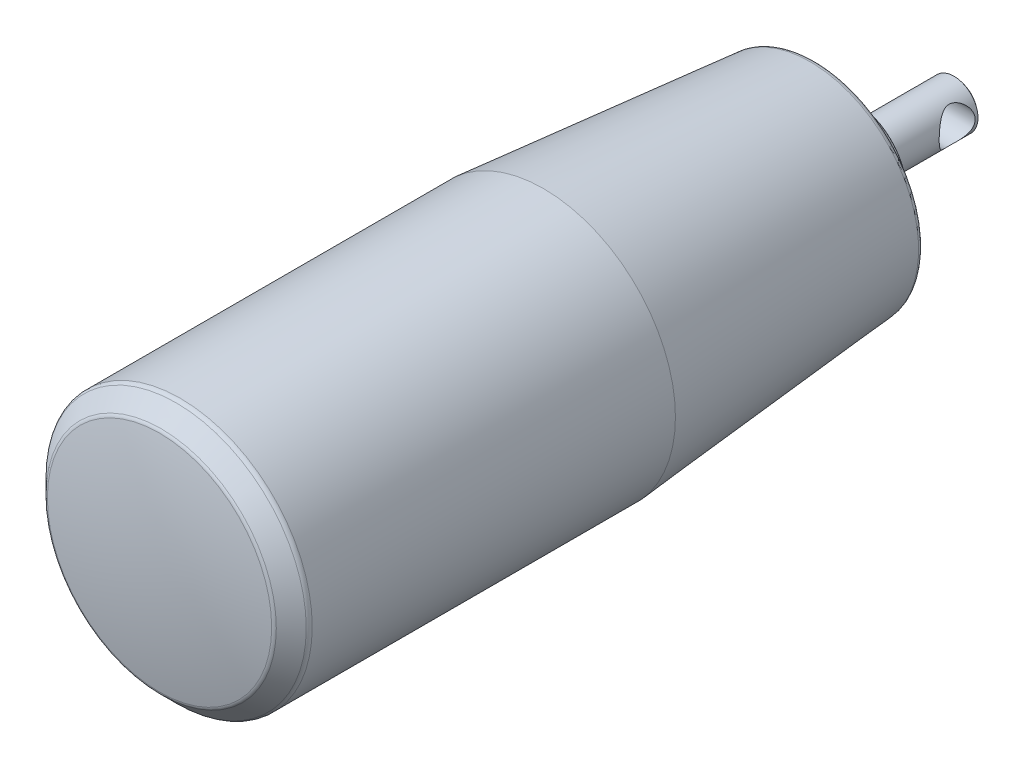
ISO-10303-21;
HEADER;
FILE_DESCRIPTION(('STEP AP214'),'2;1');
FILE_NAME('part.step','',(''),(''),'','','');
FILE_SCHEMA(('AUTOMOTIVE_DESIGN { 1 0 10303 214 1 1 1 1 }'));
ENDSEC;
DATA;
#1=APPLICATION_CONTEXT('core data for automotive mechanical design processes');
#2=APPLICATION_PROTOCOL_DEFINITION('international standard','automotive_design',2000,#1);
#3=PRODUCT_CONTEXT('',#1,'mechanical');
#4=PRODUCT('Part','Part','',(#3));
#5=PRODUCT_RELATED_PRODUCT_CATEGORY('part','',(#4));
#6=PRODUCT_DEFINITION_FORMATION('','',#4);
#7=PRODUCT_DEFINITION_CONTEXT('part definition',#1,'design');
#8=PRODUCT_DEFINITION('design','',#6,#7);
#9=PRODUCT_DEFINITION_SHAPE('','',#8);
#10=(LENGTH_UNIT() NAMED_UNIT(*) SI_UNIT(.MILLI.,.METRE.));
#11=(NAMED_UNIT(*) PLANE_ANGLE_UNIT() SI_UNIT($,.RADIAN.));
#12=(NAMED_UNIT(*) SI_UNIT($,.STERADIAN.) SOLID_ANGLE_UNIT());
#13=UNCERTAINTY_MEASURE_WITH_UNIT(LENGTH_MEASURE(1.E-05),#10,'distance_accuracy_value','');
#14=(GEOMETRIC_REPRESENTATION_CONTEXT(3) GLOBAL_UNCERTAINTY_ASSIGNED_CONTEXT((#13)) GLOBAL_UNIT_ASSIGNED_CONTEXT((#10,
#11,#12)) REPRESENTATION_CONTEXT('',''));
#15=CARTESIAN_POINT('',(0.,0.,0.));
#16=DIRECTION('',(0.,0.,1.));
#17=DIRECTION('',(1.,0.,0.));
#18=AXIS2_PLACEMENT_3D('',#15,#16,#17);
#19=CARTESIAN_POINT('',(0.,2.93123297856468E-06,19.875));
#20=DIRECTION('',(1.,0.,0.));
#21=DIRECTION('',(0.,0.,-1.));
#22=AXIS2_PLACEMENT_3D('',#19,#20,#21);
#23=SPHERICAL_SURFACE('',#22,45.6249999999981);
#24=CARTESIAN_POINT('',(0.,2.93123297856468E-06,19.875));
#25=DIRECTION('',(0.,0.,-1.));
#26=DIRECTION('',(-1.,0.,0.));
#27=AXIS2_PLACEMENT_3D('',#24,#25,#26);
#28=SPHERICAL_SURFACE('',#27,45.6249999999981);
#29=CARTESIAN_POINT('',(0.,0.,64.5308451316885));
#30=DIRECTION('',(0.,0.,-1.));
#31=DIRECTION('',(-1.,0.,0.));
#32=AXIS2_PLACEMENT_3D('',#29,#30,#31);
#33=CIRCLE('',#32,9.3539390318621);
#34=CARTESIAN_POINT('',(-9.3539390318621,0.,64.5308451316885));
#35=VERTEX_POINT('',#34);
#36=EDGE_CURVE('E75',#35,#35,#33,.T.);
#37=ORIENTED_EDGE('',*,*,#36,.F.);
#38=EDGE_LOOP('',(#37));
#39=FACE_BOUND('',#38,.T.);
#40=ADVANCED_FACE('F14',(#39),#28,.T.);
#41=CARTESIAN_POINT('',(0.,2.00000302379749,6.5));
#42=DIRECTION('',(0.,0.,-1.));
#43=DIRECTION('',(-1.,0.,0.));
#44=AXIS2_PLACEMENT_3D('',#41,#42,#43);
#45=PLANE('',#44);
#46=CARTESIAN_POINT('',(0.,0.,6.5));
#47=DIRECTION('',(0.,0.,-1.));
#48=DIRECTION('',(-1.,0.,0.));
#49=AXIS2_PLACEMENT_3D('',#46,#47,#48);
#50=CIRCLE('',#49,2.);
#51=CARTESIAN_POINT('',(-2.,0.,6.5));
#52=VERTEX_POINT('',#51);
#53=EDGE_CURVE('E40',#52,#52,#50,.T.);
#54=ORIENTED_EDGE('',*,*,#53,.F.);
#55=EDGE_LOOP('',(#54));
#56=FACE_BOUND('',#55,.T.);
#57=CARTESIAN_POINT('',(0.,0.,6.5));
#58=DIRECTION('',(0.,0.,-1.));
#59=DIRECTION('',(-1.,0.,0.));
#60=AXIS2_PLACEMENT_3D('',#57,#58,#59);
#61=CIRCLE('',#60,4.07643946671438);
#62=CARTESIAN_POINT('',(-4.07643946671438,0.,6.5));
#63=VERTEX_POINT('',#62);
#64=EDGE_CURVE('E9',#63,#63,#61,.T.);
#65=ORIENTED_EDGE('',*,*,#64,.T.);
#66=EDGE_LOOP('',(#65));
#67=FACE_BOUND('',#66,.T.);
#68=ADVANCED_FACE('F65',(#56,#67),#45,.T.);
#69=CARTESIAN_POINT('',(0.,0.,7.));
#70=DIRECTION('',(0.,0.,-1.));
#71=DIRECTION('',(-1.,0.,0.));
#72=AXIS2_PLACEMENT_3D('',#69,#70,#71);
#73=TOROIDAL_SURFACE('',#72,4.07643946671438,0.500000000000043);
#74=CARTESIAN_POINT('',(0.,0.,6.91780052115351));
#75=DIRECTION('',(0.,0.,-1.));
#76=DIRECTION('',(-1.,0.,0.));
#77=AXIS2_PLACEMENT_3D('',#74,#75,#76);
#78=CIRCLE('',#77,4.5696364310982);
#79=CARTESIAN_POINT('',(-4.5696364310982,0.,6.91780052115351));
#80=VERTEX_POINT('',#79);
#81=EDGE_CURVE('E21',#80,#80,#78,.T.);
#82=ORIENTED_EDGE('',*,*,#81,.T.);
#83=EDGE_LOOP('',(#82));
#84=FACE_BOUND('',#83,.T.);
#85=ORIENTED_EDGE('',*,*,#64,.F.);
#86=EDGE_LOOP('',(#85));
#87=FACE_BOUND('',#86,.T.);
#88=ADVANCED_FACE('F71',(#84,#87),#73,.T.);
#89=CARTESIAN_POINT('',(0.,0.,9.5));
#90=DIRECTION('',(0.,0.,1.));
#91=DIRECTION('',(1.,0.,0.));
#92=AXIS2_PLACEMENT_3D('',#89,#90,#91);
#93=CONICAL_SURFACE('',#92,5.00000293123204,0.165148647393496);
#94=ORIENTED_EDGE('',*,*,#81,.F.);
#95=EDGE_LOOP('',(#94));
#96=FACE_BOUND('',#95,.T.);
#97=CARTESIAN_POINT('',(0.,0.,9.5));
#98=DIRECTION('',(0.,0.,-1.));
#99=DIRECTION('',(-1.,0.,0.));
#100=AXIS2_PLACEMENT_3D('',#97,#98,#99);
#101=CIRCLE('',#100,5.00000293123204);
#102=CARTESIAN_POINT('',(-5.00000293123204,0.,9.5));
#103=VERTEX_POINT('',#102);
#104=EDGE_CURVE('E105',#103,#103,#101,.T.);
#105=ORIENTED_EDGE('',*,*,#104,.T.);
#106=EDGE_LOOP('',(#105));
#107=FACE_BOUND('',#106,.T.);
#108=ADVANCED_FACE('F112',(#96,#107),#93,.T.);
#109=CARTESIAN_POINT('',(0.,5.00000293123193,9.5));
#110=DIRECTION('',(0.,0.,-1.));
#111=DIRECTION('',(-1.,0.,0.));
#112=AXIS2_PLACEMENT_3D('',#109,#110,#111);
#113=PLANE('',#112);
#114=CARTESIAN_POINT('',(0.,0.,9.5));
#115=DIRECTION('',(0.,0.,-1.));
#116=DIRECTION('',(-1.,0.,0.));
#117=AXIS2_PLACEMENT_3D('',#114,#115,#116);
#118=CIRCLE('',#117,7.00000293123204);
#119=CARTESIAN_POINT('',(-7.00000293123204,0.,9.5));
#120=VERTEX_POINT('',#119);
#121=EDGE_CURVE('E102',#120,#120,#118,.T.);
#122=ORIENTED_EDGE('',*,*,#121,.T.);
#123=EDGE_LOOP('',(#122));
#124=FACE_BOUND('',#123,.T.);
#125=ORIENTED_EDGE('',*,*,#104,.F.);
#126=EDGE_LOOP('',(#125));
#127=FACE_BOUND('',#126,.T.);
#128=ADVANCED_FACE('F115',(#124,#127),#113,.T.);
#129=CARTESIAN_POINT('',(0.,0.,-10.5));
#130=DIRECTION('',(0.,0.,-1.));
#131=DIRECTION('',(-1.,0.,0.));
#132=AXIS2_PLACEMENT_3D('',#129,#130,#131);
#133=CYLINDRICAL_SURFACE('',#132,7.00000293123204);
#134=CARTESIAN_POINT('',(0.,0.,9.8));
#135=DIRECTION('',(0.,0.,-1.));
#136=DIRECTION('',(-1.,0.,0.));
#137=AXIS2_PLACEMENT_3D('',#134,#135,#136);
#138=CIRCLE('',#137,7.00000293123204);
#139=CARTESIAN_POINT('',(-7.00000293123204,0.,9.8));
#140=VERTEX_POINT('',#139);
#141=EDGE_CURVE('E99',#140,#140,#138,.T.);
#142=ORIENTED_EDGE('',*,*,#141,.T.);
#143=EDGE_LOOP('',(#142));
#144=FACE_BOUND('',#143,.T.);
#145=ORIENTED_EDGE('',*,*,#121,.F.);
#146=EDGE_LOOP('',(#145));
#147=FACE_BOUND('',#146,.T.);
#148=ADVANCED_FACE('F120',(#144,#147),#133,.T.);
#149=CARTESIAN_POINT('',(0.,7.00000293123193,9.8));
#150=DIRECTION('',(0.,0.,-1.));
#151=DIRECTION('',(-1.,0.,0.));
#152=AXIS2_PLACEMENT_3D('',#149,#150,#151);
#153=PLANE('',#152);
#154=CARTESIAN_POINT('',(0.,0.,9.8));
#155=DIRECTION('',(0.,0.,-1.));
#156=DIRECTION('',(-1.,0.,0.));
#157=AXIS2_PLACEMENT_3D('',#154,#155,#156);
#158=CIRCLE('',#157,8.54211889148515);
#159=CARTESIAN_POINT('',(-8.54211889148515,0.,9.8));
#160=VERTEX_POINT('',#159);
#161=EDGE_CURVE('E96',#160,#160,#158,.T.);
#162=ORIENTED_EDGE('',*,*,#161,.T.);
#163=EDGE_LOOP('',(#162));
#164=FACE_BOUND('',#163,.T.);
#165=ORIENTED_EDGE('',*,*,#141,.F.);
#166=EDGE_LOOP('',(#165));
#167=FACE_BOUND('',#166,.T.);
#168=ADVANCED_FACE('F127',(#164,#167),#153,.T.);
#169=CARTESIAN_POINT('',(0.,0.,10.3));
#170=DIRECTION('',(0.,0.,-1.));
#171=DIRECTION('',(-1.,0.,0.));
#172=AXIS2_PLACEMENT_3D('',#169,#170,#171);
#173=TOROIDAL_SURFACE('',#172,8.54211889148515,0.5);
#174=CARTESIAN_POINT('',(0.,0.,10.256117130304));
#175=DIRECTION('',(0.,0.,-1.));
#176=DIRECTION('',(-1.,0.,0.));
#177=AXIS2_PLACEMENT_3D('',#174,#175,#176);
#178=CIRCLE('',#177,9.04018946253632);
#179=CARTESIAN_POINT('',(-9.04018946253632,0.,10.256117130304));
#180=VERTEX_POINT('',#179);
#181=EDGE_CURVE('E93',#180,#180,#178,.T.);
#182=ORIENTED_EDGE('',*,*,#181,.T.);
#183=EDGE_LOOP('',(#182));
#184=FACE_BOUND('',#183,.T.);
#185=ORIENTED_EDGE('',*,*,#161,.F.);
#186=EDGE_LOOP('',(#185));
#187=FACE_BOUND('',#186,.T.);
#188=ADVANCED_FACE('F170',(#184,#187),#173,.T.);
#189=CARTESIAN_POINT('',(0.,0.,32.5));
#190=DIRECTION('',(0.,0.,1.));
#191=DIRECTION('',(1.,0.,0.));
#192=AXIS2_PLACEMENT_3D('',#189,#190,#191);
#193=CONICAL_SURFACE('',#192,11.000002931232,0.0878788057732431);
#194=ORIENTED_EDGE('',*,*,#181,.F.);
#195=EDGE_LOOP('',(#194));
#196=FACE_BOUND('',#195,.T.);
#197=CARTESIAN_POINT('',(0.,0.,32.5));
#198=DIRECTION('',(0.,0.,-1.));
#199=DIRECTION('',(-1.,0.,0.));
#200=AXIS2_PLACEMENT_3D('',#197,#198,#199);
#201=CIRCLE('',#200,11.000002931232);
#202=CARTESIAN_POINT('',(-11.000002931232,0.,32.5));
#203=VERTEX_POINT('',#202);
#204=EDGE_CURVE('E90',#203,#203,#201,.T.);
#205=ORIENTED_EDGE('',*,*,#204,.T.);
#206=EDGE_LOOP('',(#205));
#207=FACE_BOUND('',#206,.T.);
#208=ADVANCED_FACE('F177',(#196,#207),#193,.T.);
#209=CARTESIAN_POINT('',(0.,0.,-10.5));
#210=DIRECTION('',(0.,0.,-1.));
#211=DIRECTION('',(-1.,0.,0.));
#212=AXIS2_PLACEMENT_3D('',#209,#210,#211);
#213=CYLINDRICAL_SURFACE('',#212,11.000002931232);
#214=CARTESIAN_POINT('',(0.,0.,62.7928932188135));
#215=DIRECTION('',(0.,0.,-1.));
#216=DIRECTION('',(-1.,0.,0.));
#217=AXIS2_PLACEMENT_3D('',#214,#215,#216);
#218=CIRCLE('',#217,11.000002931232);
#219=CARTESIAN_POINT('',(-11.000002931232,0.,62.7928932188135));
#220=VERTEX_POINT('',#219);
#221=EDGE_CURVE('E87',#220,#220,#218,.T.);
#222=ORIENTED_EDGE('',*,*,#221,.T.);
#223=EDGE_LOOP('',(#222));
#224=FACE_BOUND('',#223,.T.);
#225=ORIENTED_EDGE('',*,*,#204,.F.);
#226=EDGE_LOOP('',(#225));
#227=FACE_BOUND('',#226,.T.);
#228=ADVANCED_FACE('F186',(#224,#227),#213,.T.);
#229=CARTESIAN_POINT('',(0.,0.,62.7928932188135));
#230=DIRECTION('',(0.,0.,-1.));
#231=DIRECTION('',(-1.,0.,0.));
#232=AXIS2_PLACEMENT_3D('',#229,#230,#231);
#233=TOROIDAL_SURFACE('',#232,10.500002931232,0.500000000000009);
#234=CARTESIAN_POINT('',(0.,0.,63.146446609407));
#235=DIRECTION('',(0.,0.,-1.));
#236=DIRECTION('',(-1.,0.,0.));
#237=AXIS2_PLACEMENT_3D('',#234,#235,#236);
#238=CIRCLE('',#237,10.8535563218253);
#239=CARTESIAN_POINT('',(-10.8535563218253,0.,63.146446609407));
#240=VERTEX_POINT('',#239);
#241=EDGE_CURVE('E80',#240,#240,#238,.T.);
#242=ORIENTED_EDGE('',*,*,#241,.T.);
#243=EDGE_LOOP('',(#242));
#244=FACE_BOUND('',#243,.T.);
#245=ORIENTED_EDGE('',*,*,#221,.F.);
#246=EDGE_LOOP('',(#245));
#247=FACE_BOUND('',#246,.T.);
#248=ADVANCED_FACE('F195',(#244,#247),#233,.T.);
#249=CARTESIAN_POINT('',(0.,0.,64.395019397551));
#250=DIRECTION('',(0.,0.,-1.));
#251=DIRECTION('',(-1.,0.,0.));
#252=AXIS2_PLACEMENT_3D('',#249,#250,#251);
#253=CONICAL_SURFACE('',#252,9.60498353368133,0.785398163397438);
#254=ORIENTED_EDGE('',*,*,#241,.F.);
#255=EDGE_LOOP('',(#254));
#256=FACE_BOUND('',#255,.T.);
#257=CARTESIAN_POINT('',(0.,0.,64.395019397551));
#258=DIRECTION('',(0.,0.,-1.));
#259=DIRECTION('',(-1.,0.,0.));
#260=AXIS2_PLACEMENT_3D('',#257,#258,#259);
#261=CIRCLE('',#260,9.60498353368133);
#262=CARTESIAN_POINT('',(-9.60498353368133,0.,64.395019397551));
#263=VERTEX_POINT('',#262);
#264=EDGE_CURVE('E77',#263,#263,#261,.T.);
#265=ORIENTED_EDGE('',*,*,#264,.T.);
#266=EDGE_LOOP('',(#265));
#267=FACE_BOUND('',#266,.T.);
#268=ADVANCED_FACE('F204',(#256,#267),#253,.T.);
#269=CARTESIAN_POINT('',(0.,0.,64.0414660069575));
#270=DIRECTION('',(0.,0.,-1.));
#271=DIRECTION('',(-1.,0.,0.));
#272=AXIS2_PLACEMENT_3D('',#269,#270,#271);
#273=TOROIDAL_SURFACE('',#272,9.2514301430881,0.5);
#274=ORIENTED_EDGE('',*,*,#36,.T.);
#275=EDGE_LOOP('',(#274));
#276=FACE_BOUND('',#275,.T.);
#277=ORIENTED_EDGE('',*,*,#264,.F.);
#278=EDGE_LOOP('',(#277));
#279=FACE_BOUND('',#278,.T.);
#280=ADVANCED_FACE('F62',(#276,#279),#273,.T.);
#281=CARTESIAN_POINT('',(0.,0.,-2.5));
#282=DIRECTION('',(0.,0.,1.));
#283=DIRECTION('',(1.,0.,0.));
#284=AXIS2_PLACEMENT_3D('',#281,#282,#283);
#285=CYLINDRICAL_SURFACE('',#284,2.);
#286=CARTESIAN_POINT('',(0.,0.,-1.73606797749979));
#287=DIRECTION('',(0.,0.,1.));
#288=DIRECTION('',(1.,0.,0.));
#289=AXIS2_PLACEMENT_3D('',#286,#287,#288);
#290=CIRCLE('',#289,2.);
#291=CARTESIAN_POINT('',(2.,0.,-1.73606797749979));
#292=VERTEX_POINT('',#291);
#293=EDGE_CURVE('E17',#292,#292,#290,.T.);
#294=ORIENTED_EDGE('',*,*,#293,.T.);
#295=EDGE_LOOP('',(#294));
#296=FACE_BOUND('',#295,.T.);
#297=CARTESIAN_POINT('',(2.,0.,-1.5));
#298=CARTESIAN_POINT('',(1.99999540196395,-0.0732207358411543,-1.49999520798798));
#299=CARTESIAN_POINT('',(1.99593645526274,-0.146561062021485,-1.4945949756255));
#300=CARTESIAN_POINT('',(1.98006607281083,-0.290936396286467,-1.47333293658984));
#301=CARTESIAN_POINT('',(1.96823514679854,-0.361965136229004,-1.45744482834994));
#302=CARTESIAN_POINT('',(1.9379567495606,-0.49923462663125,-1.41628709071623));
#303=CARTESIAN_POINT('',(1.91954951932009,-0.565501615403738,-1.39107448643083));
#304=CARTESIAN_POINT('',(1.87750556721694,-0.692422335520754,-1.33245765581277));
#305=CARTESIAN_POINT('',(1.85387037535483,-0.753077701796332,-1.29905582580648));
#306=CARTESIAN_POINT('',(1.80049544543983,-0.873465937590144,-1.22173698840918));
#307=CARTESIAN_POINT('',(1.77039308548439,-0.932593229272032,-1.17713267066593));
#308=CARTESIAN_POINT('',(1.70767017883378,-1.04302716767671,-1.08050416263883));
#309=CARTESIAN_POINT('',(1.67504578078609,-1.09432148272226,-1.02846851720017));
#310=CARTESIAN_POINT('',(1.6027112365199,-1.19837161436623,-0.906417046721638));
#311=CARTESIAN_POINT('',(1.56290854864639,-1.24930578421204,-0.834896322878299));
#312=CARTESIAN_POINT('',(1.48711444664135,-1.33861998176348,-0.682548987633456));
#313=CARTESIAN_POINT('',(1.45111786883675,-1.37701716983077,-0.601735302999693));
#314=CARTESIAN_POINT('',(1.39977155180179,-1.42880627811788,-0.460497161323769));
#315=CARTESIAN_POINT('',(1.38157751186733,-1.44625674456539,-0.40260930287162));
#316=CARTESIAN_POINT('',(1.35171594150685,-1.47420672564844,-0.283607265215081));
#317=CARTESIAN_POINT('',(1.34003347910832,-1.48472215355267,-0.222500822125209));
#318=CARTESIAN_POINT('',(1.32503759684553,-1.49812822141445,-0.0978174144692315));
#319=CARTESIAN_POINT('',(1.32180026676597,-1.50094954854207,-0.0342231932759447));
#320=CARTESIAN_POINT('',(1.32459531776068,-1.49848213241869,0.0926149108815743));
#321=CARTESIAN_POINT('',(1.33063102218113,-1.49319048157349,0.155858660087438));
#322=CARTESIAN_POINT('',(1.34967623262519,-1.47597739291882,0.27319134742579));
#323=CARTESIAN_POINT('',(1.36187157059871,-1.46482486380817,0.327536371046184));
#324=CARTESIAN_POINT('',(1.39114192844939,-1.43705671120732,0.433438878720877));
#325=CARTESIAN_POINT('',(1.40822163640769,-1.42043583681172,0.484993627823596));
#326=CARTESIAN_POINT('',(1.45741769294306,-1.37033064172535,0.61625638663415));
#327=CARTESIAN_POINT('',(1.49225649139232,-1.3328014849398,0.693400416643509));
#328=CARTESIAN_POINT('',(1.56533298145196,-1.24618023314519,0.839196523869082));
#329=CARTESIAN_POINT('',(1.60357878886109,-1.19706004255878,0.907827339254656));
#330=CARTESIAN_POINT('',(1.68051672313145,-1.08651604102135,1.03775339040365));
#331=CARTESIAN_POINT('',(1.71919586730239,-1.02481375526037,1.09882060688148));
#332=CARTESIAN_POINT('',(1.79248037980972,-0.890422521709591,1.21026364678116));
#333=CARTESIAN_POINT('',(1.8270934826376,-0.817755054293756,1.26065992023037));
#334=CARTESIAN_POINT('',(1.88279726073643,-0.677902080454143,1.33998079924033));
#335=CARTESIAN_POINT('',(1.90520770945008,-0.612539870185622,1.37118459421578));
#336=CARTESIAN_POINT('',(1.94372904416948,-0.476352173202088,1.42422488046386));
#337=CARTESIAN_POINT('',(1.95984387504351,-0.405530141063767,1.44606723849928));
#338=CARTESIAN_POINT('',(1.98445588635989,-0.259676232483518,1.47925336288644));
#339=CARTESIAN_POINT('',(1.99290592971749,-0.184621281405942,1.49053217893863));
#340=CARTESIAN_POINT('',(2.00115883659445,-0.0332012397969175,1.50154959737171));
#341=CARTESIAN_POINT('',(2.00096534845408,0.0431632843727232,1.50129306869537));
#342=CARTESIAN_POINT('',(1.99242547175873,0.186804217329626,1.48988913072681));
#343=CARTESIAN_POINT('',(1.98490086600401,0.254222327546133,1.47983946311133));
#344=CARTESIAN_POINT('',(1.96351320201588,0.386110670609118,1.45102621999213));
#345=CARTESIAN_POINT('',(1.94964879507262,0.45058027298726,1.43226079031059));
#346=CARTESIAN_POINT('',(1.91599830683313,0.577416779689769,1.38611246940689));
#347=CARTESIAN_POINT('',(1.89602050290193,0.639629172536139,1.3584488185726));
#348=CARTESIAN_POINT('',(1.85166985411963,0.758518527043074,1.29582754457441));
#349=CARTESIAN_POINT('',(1.82729640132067,0.815194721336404,1.26086891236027));
#350=CARTESIAN_POINT('',(1.77119146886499,0.931511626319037,1.17821675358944));
#351=CARTESIAN_POINT('',(1.73891095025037,0.990066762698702,1.12937146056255));
#352=CARTESIAN_POINT('',(1.67238952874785,1.09871974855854,1.02399124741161));
#353=CARTESIAN_POINT('',(1.63814438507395,1.14879830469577,0.967439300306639));
#354=CARTESIAN_POINT('',(1.56369128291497,1.24877541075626,0.835850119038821));
#355=CARTESIAN_POINT('',(1.523587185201,1.29683043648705,0.759342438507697));
#356=CARTESIAN_POINT('',(1.4494059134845,1.37923235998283,0.596639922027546));
#357=CARTESIAN_POINT('',(1.41531099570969,1.41362000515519,0.510474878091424));
#358=CARTESIAN_POINT('',(1.37118877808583,1.45615734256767,0.364585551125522));
#359=CARTESIAN_POINT('',(1.35695811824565,1.46931009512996,0.307608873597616));
#360=CARTESIAN_POINT('',(1.33542056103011,1.48891522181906,0.191292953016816));
#361=CARTESIAN_POINT('',(1.32809821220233,1.4953825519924,0.131959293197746));
#362=CARTESIAN_POINT('',(1.32157601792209,1.50115320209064,0.0121709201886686));
#363=CARTESIAN_POINT('',(1.32241740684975,1.50042015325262,-0.0482879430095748));
#364=CARTESIAN_POINT('',(1.33216448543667,1.49176883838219,-0.168056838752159));
#365=CARTESIAN_POINT('',(1.34108058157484,1.48384130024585,-0.227365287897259));
#366=CARTESIAN_POINT('',(1.36817348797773,1.45893841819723,-0.355914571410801));
#367=CARTESIAN_POINT('',(1.38794705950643,1.44036567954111,-0.424497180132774));
#368=CARTESIAN_POINT('',(1.4338296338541,1.39469627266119,-0.556534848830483));
#369=CARTESIAN_POINT('',(1.4599546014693,1.3675780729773,-0.619976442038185));
#370=CARTESIAN_POINT('',(1.52516477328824,1.29498918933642,-0.762520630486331));
#371=CARTESIAN_POINT('',(1.56560203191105,1.2464154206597,-0.839421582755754));
#372=CARTESIAN_POINT('',(1.64713510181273,1.13650718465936,-0.983126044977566));
#373=CARTESIAN_POINT('',(1.68823146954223,1.07516134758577,-1.04992046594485));
#374=CARTESIAN_POINT('',(1.76728988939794,0.939627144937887,-1.17283184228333));
#375=CARTESIAN_POINT('',(1.80522333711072,0.865337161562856,-1.2288563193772));
#376=CARTESIAN_POINT('',(1.87357289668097,0.7051590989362,-1.32722305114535));
#377=CARTESIAN_POINT('',(1.90400691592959,0.619299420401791,-1.36959797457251));
#378=CARTESIAN_POINT('',(1.94636704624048,0.464840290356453,-1.42779942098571));
#379=CARTESIAN_POINT('',(1.96110322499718,0.398553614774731,-1.44776673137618));
#380=CARTESIAN_POINT('',(1.98383739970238,0.262841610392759,-1.47841790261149));
#381=CARTESIAN_POINT('',(1.99185421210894,0.193425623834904,-1.48912769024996));
#382=CARTESIAN_POINT('',(1.99745471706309,0.102963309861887,-1.49660469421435));
#383=CARTESIAN_POINT('',(1.9984076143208,0.0824069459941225,-1.49787627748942));
#384=CARTESIAN_POINT('',(1.99968095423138,0.0412368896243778,-1.49957467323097));
#385=CARTESIAN_POINT('',(2.00000129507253,0.0206231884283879,-1.50000134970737));
#386=CARTESIAN_POINT('',(2.,0.,-1.5));
#387=B_SPLINE_CURVE_WITH_KNOTS('',3,(#297,#298,#299,#300,#301,#302,#303,#304,#305,#306,#307,
#308,#309,#310,#311,#312,#313,#314,#315,#316,#317,#318,#319,#320,#321,#322,#323,#324,#325,#326,
#327,#328,#329,#330,#331,#332,#333,#334,#335,#336,#337,#338,#339,#340,#341,#342,#343,#344,#345,
#346,#347,#348,#349,#350,#351,#352,#353,#354,#355,#356,#357,#358,#359,#360,#361,#362,#363,#364,
#365,#366,#367,#368,#369,#370,#371,#372,#373,#374,#375,#376,#377,#378,#379,#380,#381,#382,#383,
#384,#385,#386),.UNSPECIFIED.,.T.,.F.,(4,2,2,2,2,2,2,2,2,2,2,2,2,2,2,2,2,2,2,2,2,2,2,2,2,2,2,2,
2,2,2,2,2,2,2,2,2,2,2,2,2,2,2,2,4),(0.,0.219571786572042,0.439696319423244,0.658496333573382,
0.877232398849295,1.1162243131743,1.35558868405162,1.64360015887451,1.93121574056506,
2.11999518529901,2.3083399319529,2.49837587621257,2.6884799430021,2.85826890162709,
3.0282213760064,3.3044933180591,3.58144192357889,3.8653588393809,4.1487266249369,
4.37526505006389,4.60166129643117,4.82944058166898,5.05712372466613,5.26191187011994,
5.46674360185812,5.6788043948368,5.89089453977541,6.13840382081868,6.38646908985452,
6.68168596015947,6.97601595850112,7.15589161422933,7.33536399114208,7.51574333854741,
7.69635548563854,7.91639670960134,8.13699685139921,8.43412246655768,8.73151372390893,
9.0313544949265,9.33047220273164,9.5419569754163,9.75284752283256,9.81468166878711,
9.87652576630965),.UNSPECIFIED.);
#388=CARTESIAN_POINT('',(2.,0.,-1.5));
#389=VERTEX_POINT('',#388);
#390=EDGE_CURVE('E35',#389,#389,#387,.T.);
#391=ORIENTED_EDGE('',*,*,#390,.T.);
#392=EDGE_LOOP('',(#391));
#393=FACE_BOUND('',#392,.T.);
#394=CARTESIAN_POINT('',(-2.,0.,-1.5));
#395=CARTESIAN_POINT('',(-1.99999540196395,0.0732207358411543,-1.49999520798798));
#396=CARTESIAN_POINT('',(-1.99593645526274,0.146561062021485,-1.4945949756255));
#397=CARTESIAN_POINT('',(-1.98006607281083,0.290936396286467,-1.47333293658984));
#398=CARTESIAN_POINT('',(-1.96823514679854,0.361965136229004,-1.45744482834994));
#399=CARTESIAN_POINT('',(-1.9379567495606,0.49923462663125,-1.41628709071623));
#400=CARTESIAN_POINT('',(-1.91954951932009,0.565501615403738,-1.39107448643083));
#401=CARTESIAN_POINT('',(-1.87750556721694,0.692422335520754,-1.33245765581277));
#402=CARTESIAN_POINT('',(-1.85387037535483,0.753077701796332,-1.29905582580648));
#403=CARTESIAN_POINT('',(-1.80049544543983,0.873465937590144,-1.22173698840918));
#404=CARTESIAN_POINT('',(-1.77039308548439,0.932593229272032,-1.17713267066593));
#405=CARTESIAN_POINT('',(-1.70767017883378,1.04302716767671,-1.08050416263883));
#406=CARTESIAN_POINT('',(-1.67504578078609,1.09432148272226,-1.02846851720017));
#407=CARTESIAN_POINT('',(-1.6027112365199,1.19837161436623,-0.906417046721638));
#408=CARTESIAN_POINT('',(-1.56290854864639,1.24930578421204,-0.834896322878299));
#409=CARTESIAN_POINT('',(-1.48711444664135,1.33861998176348,-0.682548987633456));
#410=CARTESIAN_POINT('',(-1.45111786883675,1.37701716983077,-0.601735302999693));
#411=CARTESIAN_POINT('',(-1.39977155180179,1.42880627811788,-0.460497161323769));
#412=CARTESIAN_POINT('',(-1.38157751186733,1.44625674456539,-0.40260930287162));
#413=CARTESIAN_POINT('',(-1.35171594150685,1.47420672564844,-0.283607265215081));
#414=CARTESIAN_POINT('',(-1.34003347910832,1.48472215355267,-0.222500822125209));
#415=CARTESIAN_POINT('',(-1.32503759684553,1.49812822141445,-0.0978174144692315));
#416=CARTESIAN_POINT('',(-1.32180026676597,1.50094954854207,-0.0342231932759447));
#417=CARTESIAN_POINT('',(-1.32459531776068,1.49848213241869,0.0926149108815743));
#418=CARTESIAN_POINT('',(-1.33063102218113,1.49319048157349,0.155858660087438));
#419=CARTESIAN_POINT('',(-1.34967623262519,1.47597739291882,0.27319134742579));
#420=CARTESIAN_POINT('',(-1.36187157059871,1.46482486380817,0.327536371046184));
#421=CARTESIAN_POINT('',(-1.39114192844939,1.43705671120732,0.433438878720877));
#422=CARTESIAN_POINT('',(-1.40822163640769,1.42043583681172,0.484993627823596));
#423=CARTESIAN_POINT('',(-1.45741769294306,1.37033064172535,0.61625638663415));
#424=CARTESIAN_POINT('',(-1.49225649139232,1.3328014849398,0.693400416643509));
#425=CARTESIAN_POINT('',(-1.56533298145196,1.24618023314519,0.839196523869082));
#426=CARTESIAN_POINT('',(-1.60357878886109,1.19706004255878,0.907827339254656));
#427=CARTESIAN_POINT('',(-1.68051672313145,1.08651604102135,1.03775339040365));
#428=CARTESIAN_POINT('',(-1.71919586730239,1.02481375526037,1.09882060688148));
#429=CARTESIAN_POINT('',(-1.79248037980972,0.890422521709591,1.21026364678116));
#430=CARTESIAN_POINT('',(-1.8270934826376,0.817755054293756,1.26065992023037));
#431=CARTESIAN_POINT('',(-1.88279726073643,0.677902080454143,1.33998079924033));
#432=CARTESIAN_POINT('',(-1.90520770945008,0.612539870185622,1.37118459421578));
#433=CARTESIAN_POINT('',(-1.94372904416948,0.476352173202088,1.42422488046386));
#434=CARTESIAN_POINT('',(-1.95984387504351,0.405530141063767,1.44606723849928));
#435=CARTESIAN_POINT('',(-1.98445588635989,0.259676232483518,1.47925336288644));
#436=CARTESIAN_POINT('',(-1.99290592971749,0.184621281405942,1.49053217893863));
#437=CARTESIAN_POINT('',(-2.00115883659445,0.0332012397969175,1.50154959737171));
#438=CARTESIAN_POINT('',(-2.00096534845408,-0.0431632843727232,1.50129306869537));
#439=CARTESIAN_POINT('',(-1.99242547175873,-0.186804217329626,1.48988913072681));
#440=CARTESIAN_POINT('',(-1.98490086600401,-0.254222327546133,1.47983946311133));
#441=CARTESIAN_POINT('',(-1.96351320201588,-0.386110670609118,1.45102621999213));
#442=CARTESIAN_POINT('',(-1.94964879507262,-0.45058027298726,1.43226079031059));
#443=CARTESIAN_POINT('',(-1.91599830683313,-0.577416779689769,1.38611246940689));
#444=CARTESIAN_POINT('',(-1.89602050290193,-0.639629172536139,1.3584488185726));
#445=CARTESIAN_POINT('',(-1.85166985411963,-0.758518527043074,1.29582754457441));
#446=CARTESIAN_POINT('',(-1.82729640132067,-0.815194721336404,1.26086891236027));
#447=CARTESIAN_POINT('',(-1.77119146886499,-0.931511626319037,1.17821675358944));
#448=CARTESIAN_POINT('',(-1.73891095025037,-0.990066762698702,1.12937146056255));
#449=CARTESIAN_POINT('',(-1.67238952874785,-1.09871974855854,1.02399124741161));
#450=CARTESIAN_POINT('',(-1.63814438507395,-1.14879830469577,0.967439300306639));
#451=CARTESIAN_POINT('',(-1.56369128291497,-1.24877541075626,0.835850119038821));
#452=CARTESIAN_POINT('',(-1.523587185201,-1.29683043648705,0.759342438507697));
#453=CARTESIAN_POINT('',(-1.4494059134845,-1.37923235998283,0.596639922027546));
#454=CARTESIAN_POINT('',(-1.41531099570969,-1.41362000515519,0.510474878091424));
#455=CARTESIAN_POINT('',(-1.37118877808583,-1.45615734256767,0.364585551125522));
#456=CARTESIAN_POINT('',(-1.35695811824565,-1.46931009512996,0.307608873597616));
#457=CARTESIAN_POINT('',(-1.33542056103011,-1.48891522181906,0.191292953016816));
#458=CARTESIAN_POINT('',(-1.32809821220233,-1.4953825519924,0.131959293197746));
#459=CARTESIAN_POINT('',(-1.32157601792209,-1.50115320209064,0.0121709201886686));
#460=CARTESIAN_POINT('',(-1.32241740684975,-1.50042015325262,-0.0482879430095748));
#461=CARTESIAN_POINT('',(-1.33216448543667,-1.49176883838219,-0.168056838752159));
#462=CARTESIAN_POINT('',(-1.34108058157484,-1.48384130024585,-0.227365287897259));
#463=CARTESIAN_POINT('',(-1.36817348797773,-1.45893841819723,-0.355914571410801));
#464=CARTESIAN_POINT('',(-1.38794705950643,-1.44036567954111,-0.424497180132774));
#465=CARTESIAN_POINT('',(-1.4338296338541,-1.39469627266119,-0.556534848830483));
#466=CARTESIAN_POINT('',(-1.4599546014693,-1.3675780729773,-0.619976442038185));
#467=CARTESIAN_POINT('',(-1.52516477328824,-1.29498918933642,-0.762520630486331));
#468=CARTESIAN_POINT('',(-1.56560203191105,-1.2464154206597,-0.839421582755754));
#469=CARTESIAN_POINT('',(-1.64713510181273,-1.13650718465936,-0.983126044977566));
#470=CARTESIAN_POINT('',(-1.68823146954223,-1.07516134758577,-1.04992046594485));
#471=CARTESIAN_POINT('',(-1.76728988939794,-0.939627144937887,-1.17283184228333));
#472=CARTESIAN_POINT('',(-1.80522333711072,-0.865337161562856,-1.2288563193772));
#473=CARTESIAN_POINT('',(-1.87357289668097,-0.7051590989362,-1.32722305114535));
#474=CARTESIAN_POINT('',(-1.90400691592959,-0.619299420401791,-1.36959797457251));
#475=CARTESIAN_POINT('',(-1.94636704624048,-0.464840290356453,-1.42779942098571));
#476=CARTESIAN_POINT('',(-1.96110322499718,-0.398553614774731,-1.44776673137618));
#477=CARTESIAN_POINT('',(-1.98383739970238,-0.262841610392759,-1.47841790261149));
#478=CARTESIAN_POINT('',(-1.99185421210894,-0.193425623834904,-1.48912769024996));
#479=CARTESIAN_POINT('',(-1.99745471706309,-0.102963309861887,-1.49660469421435));
#480=CARTESIAN_POINT('',(-1.9984076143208,-0.0824069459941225,-1.49787627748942));
#481=CARTESIAN_POINT('',(-1.99968095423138,-0.0412368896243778,-1.49957467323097));
#482=CARTESIAN_POINT('',(-2.00000129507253,-0.0206231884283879,-1.50000134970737));
#483=CARTESIAN_POINT('',(-2.,0.,-1.5));
#484=B_SPLINE_CURVE_WITH_KNOTS('',3,(#394,#395,#396,#397,#398,#399,#400,#401,#402,#403,#404,
#405,#406,#407,#408,#409,#410,#411,#412,#413,#414,#415,#416,#417,#418,#419,#420,#421,#422,#423,
#424,#425,#426,#427,#428,#429,#430,#431,#432,#433,#434,#435,#436,#437,#438,#439,#440,#441,#442,
#443,#444,#445,#446,#447,#448,#449,#450,#451,#452,#453,#454,#455,#456,#457,#458,#459,#460,#461,
#462,#463,#464,#465,#466,#467,#468,#469,#470,#471,#472,#473,#474,#475,#476,#477,#478,#479,#480,
#481,#482,#483),.UNSPECIFIED.,.T.,.F.,(4,2,2,2,2,2,2,2,2,2,2,2,2,2,2,2,2,2,2,2,2,2,2,2,2,2,2,2,
2,2,2,2,2,2,2,2,2,2,2,2,2,2,2,2,4),(0.,0.219571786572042,0.439696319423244,0.658496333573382,
0.877232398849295,1.1162243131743,1.35558868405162,1.64360015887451,1.93121574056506,
2.11999518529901,2.3083399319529,2.49837587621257,2.6884799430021,2.85826890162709,
3.0282213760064,3.3044933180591,3.58144192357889,3.8653588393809,4.1487266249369,
4.37526505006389,4.60166129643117,4.82944058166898,5.05712372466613,5.26191187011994,
5.46674360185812,5.6788043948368,5.89089453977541,6.13840382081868,6.38646908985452,
6.68168596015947,6.97601595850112,7.15589161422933,7.33536399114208,7.51574333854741,
7.69635548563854,7.91639670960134,8.13699685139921,8.43412246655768,8.73151372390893,
9.0313544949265,9.33047220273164,9.5419569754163,9.75284752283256,9.81468166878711,
9.87652576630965),.UNSPECIFIED.);
#485=CARTESIAN_POINT('',(-2.,0.,-1.5));
#486=VERTEX_POINT('',#485);
#487=EDGE_CURVE('E33',#486,#486,#484,.T.);
#488=ORIENTED_EDGE('',*,*,#487,.T.);
#489=EDGE_LOOP('',(#488));
#490=FACE_BOUND('',#489,.T.);
#491=ORIENTED_EDGE('',*,*,#53,.T.);
#492=EDGE_LOOP('',(#491));
#493=FACE_BOUND('',#492,.T.);
#494=ADVANCED_FACE('F50',(#296,#393,#490,#493),#285,.T.);
#495=CARTESIAN_POINT('',(-5.,0.,0.));
#496=DIRECTION('',(1.,0.,0.));
#497=DIRECTION('',(0.,0.,-1.));
#498=AXIS2_PLACEMENT_3D('',#495,#496,#497);
#499=CYLINDRICAL_SURFACE('',#498,1.5);
#500=ORIENTED_EDGE('',*,*,#487,.F.);
#501=EDGE_LOOP('',(#500));
#502=FACE_BOUND('',#501,.T.);
#503=ORIENTED_EDGE('',*,*,#390,.F.);
#504=EDGE_LOOP('',(#503));
#505=FACE_BOUND('',#504,.T.);
#506=ADVANCED_FACE('F28',(#502,#505),#499,.F.);
#507=CARTESIAN_POINT('',(0.,0.,0.5));
#508=DIRECTION('',(0.,0.,-1.));
#509=DIRECTION('',(0.,1.,0.));
#510=AXIS2_PLACEMENT_3D('',#507,#508,#509);
#511=SPHERICAL_SURFACE('',#510,3.);
#512=CARTESIAN_POINT('',(0.,0.,-2.5));
#513=VERTEX_POINT('',#512);
#514=VERTEX_LOOP('',#513);
#515=FACE_BOUND('',#514,.T.);
#516=ORIENTED_EDGE('',*,*,#293,.F.);
#517=EDGE_LOOP('',(#516));
#518=FACE_BOUND('',#517,.T.);
#519=ADVANCED_FACE('F25',(#515,#518),#511,.T.);
#520=CLOSED_SHELL('',(#40,#68,#88,#108,#128,#148,#168,#188,#208,#228,#248,#268,#280,#494,#506,#519));
#521=MANIFOLD_SOLID_BREP('B1',#520);
#522=ADVANCED_BREP_SHAPE_REPRESENTATION('',(#18,#521),#14);
#523=SHAPE_DEFINITION_REPRESENTATION(#9,#522);
ENDSEC;
END-ISO-10303-21;
